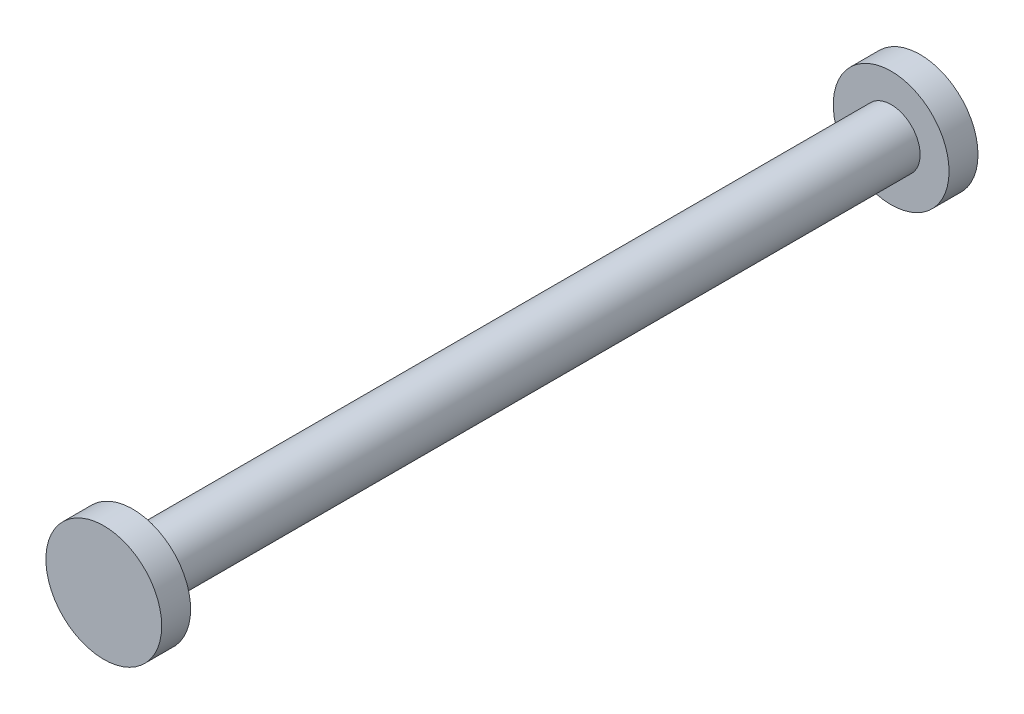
ISO-10303-21;
HEADER;
FILE_DESCRIPTION(('STEP AP214'),'2;1');
FILE_NAME('part.step','',(''),(''),'','','');
FILE_SCHEMA(('AUTOMOTIVE_DESIGN { 1 0 10303 214 1 1 1 1 }'));
ENDSEC;
DATA;
#1=APPLICATION_CONTEXT('core data for automotive mechanical design processes');
#2=APPLICATION_PROTOCOL_DEFINITION('international standard','automotive_design',2000,#1);
#3=PRODUCT_CONTEXT('',#1,'mechanical');
#4=PRODUCT('Part','Part','',(#3));
#5=PRODUCT_RELATED_PRODUCT_CATEGORY('part','',(#4));
#6=PRODUCT_DEFINITION_FORMATION('','',#4);
#7=PRODUCT_DEFINITION_CONTEXT('part definition',#1,'design');
#8=PRODUCT_DEFINITION('design','',#6,#7);
#9=PRODUCT_DEFINITION_SHAPE('','',#8);
#10=(LENGTH_UNIT() NAMED_UNIT(*) SI_UNIT(.MILLI.,.METRE.));
#11=(NAMED_UNIT(*) PLANE_ANGLE_UNIT() SI_UNIT($,.RADIAN.));
#12=(NAMED_UNIT(*) SI_UNIT($,.STERADIAN.) SOLID_ANGLE_UNIT());
#13=UNCERTAINTY_MEASURE_WITH_UNIT(LENGTH_MEASURE(1.E-05),#10,'distance_accuracy_value','');
#14=(GEOMETRIC_REPRESENTATION_CONTEXT(3) GLOBAL_UNCERTAINTY_ASSIGNED_CONTEXT((#13)) GLOBAL_UNIT_ASSIGNED_CONTEXT((#10,
#11,#12)) REPRESENTATION_CONTEXT('',''));
#15=CARTESIAN_POINT('',(0.,0.,0.));
#16=DIRECTION('',(0.,0.,1.));
#17=DIRECTION('',(1.,0.,0.));
#18=AXIS2_PLACEMENT_3D('',#15,#16,#17);
#19=CARTESIAN_POINT('',(0.,0.,5.));
#20=DIRECTION('',(0.,0.,-1.));
#21=DIRECTION('',(-1.,0.,0.));
#22=AXIS2_PLACEMENT_3D('',#19,#20,#21);
#23=CYLINDRICAL_SURFACE('',#22,10.);
#24=CARTESIAN_POINT('',(0.,0.,5.));
#25=DIRECTION('',(0.,0.,1.));
#26=DIRECTION('',(1.,0.,0.));
#27=AXIS2_PLACEMENT_3D('',#24,#25,#26);
#28=CIRCLE('',#27,10.);
#29=CARTESIAN_POINT('',(10.,0.,5.));
#30=VERTEX_POINT('',#29);
#31=EDGE_CURVE('E38',#30,#30,#28,.T.);
#32=ORIENTED_EDGE('',*,*,#31,.F.);
#33=EDGE_LOOP('',(#32));
#34=FACE_BOUND('',#33,.T.);
#35=CARTESIAN_POINT('',(0.,0.,0.));
#36=DIRECTION('',(0.,0.,1.));
#37=DIRECTION('',(1.,0.,0.));
#38=AXIS2_PLACEMENT_3D('',#35,#36,#37);
#39=CIRCLE('',#38,10.);
#40=CARTESIAN_POINT('',(10.,0.,0.));
#41=VERTEX_POINT('',#40);
#42=EDGE_CURVE('E34',#41,#41,#39,.T.);
#43=ORIENTED_EDGE('',*,*,#42,.T.);
#44=EDGE_LOOP('',(#43));
#45=FACE_BOUND('',#44,.T.);
#46=ADVANCED_FACE('F31',(#34,#45),#23,.T.);
#47=CARTESIAN_POINT('',(0.,0.,5.));
#48=DIRECTION('',(0.,0.,1.));
#49=DIRECTION('',(1.,0.,0.));
#50=AXIS2_PLACEMENT_3D('',#47,#48,#49);
#51=PLANE('',#50);
#52=CARTESIAN_POINT('',(0.,0.,5.));
#53=DIRECTION('',(0.,0.,1.));
#54=DIRECTION('',(1.,0.,0.));
#55=AXIS2_PLACEMENT_3D('',#52,#53,#54);
#56=CIRCLE('',#55,5.);
#57=CARTESIAN_POINT('',(5.,0.,5.));
#58=VERTEX_POINT('',#57);
#59=EDGE_CURVE('E10',#58,#58,#56,.T.);
#60=ORIENTED_EDGE('',*,*,#59,.F.);
#61=EDGE_LOOP('',(#60));
#62=FACE_BOUND('',#61,.T.);
#63=ORIENTED_EDGE('',*,*,#31,.T.);
#64=EDGE_LOOP('',(#63));
#65=FACE_BOUND('',#64,.T.);
#66=ADVANCED_FACE('F72',(#62,#65),#51,.T.);
#67=CARTESIAN_POINT('',(0.,0.,0.));
#68=DIRECTION('',(0.,0.,1.));
#69=DIRECTION('',(1.,0.,0.));
#70=AXIS2_PLACEMENT_3D('',#67,#68,#69);
#71=PLANE('',#70);
#72=ORIENTED_EDGE('',*,*,#42,.F.);
#73=EDGE_LOOP('',(#72));
#74=FACE_BOUND('',#73,.T.);
#75=ADVANCED_FACE('F77',(#74),#71,.F.);
#76=CARTESIAN_POINT('',(0.,0.,136.));
#77=DIRECTION('',(0.,0.,-1.));
#78=DIRECTION('',(-1.,0.,0.));
#79=AXIS2_PLACEMENT_3D('',#76,#77,#78);
#80=CYLINDRICAL_SURFACE('',#79,5.);
#81=CARTESIAN_POINT('',(0.,0.,136.));
#82=DIRECTION('',(0.,0.,1.));
#83=DIRECTION('',(1.,0.,0.));
#84=AXIS2_PLACEMENT_3D('',#81,#82,#83);
#85=CIRCLE('',#84,5.);
#86=CARTESIAN_POINT('',(5.,0.,136.));
#87=VERTEX_POINT('',#86);
#88=EDGE_CURVE('E44',#87,#87,#85,.T.);
#89=ORIENTED_EDGE('',*,*,#88,.F.);
#90=EDGE_LOOP('',(#89));
#91=FACE_BOUND('',#90,.T.);
#92=ORIENTED_EDGE('',*,*,#59,.T.);
#93=EDGE_LOOP('',(#92));
#94=FACE_BOUND('',#93,.T.);
#95=ADVANCED_FACE('F59',(#91,#94),#80,.T.);
#96=CARTESIAN_POINT('',(0.,0.,141.));
#97=DIRECTION('',(0.,0.,-1.));
#98=DIRECTION('',(-1.,0.,0.));
#99=AXIS2_PLACEMENT_3D('',#96,#97,#98);
#100=CYLINDRICAL_SURFACE('',#99,10.);
#101=CARTESIAN_POINT('',(0.,0.,141.));
#102=DIRECTION('',(0.,0.,1.));
#103=DIRECTION('',(1.,0.,0.));
#104=AXIS2_PLACEMENT_3D('',#101,#102,#103);
#105=CIRCLE('',#104,10.);
#106=CARTESIAN_POINT('',(10.,0.,141.));
#107=VERTEX_POINT('',#106);
#108=EDGE_CURVE('E47',#107,#107,#105,.T.);
#109=ORIENTED_EDGE('',*,*,#108,.F.);
#110=EDGE_LOOP('',(#109));
#111=FACE_BOUND('',#110,.T.);
#112=CARTESIAN_POINT('',(0.,0.,136.));
#113=DIRECTION('',(0.,0.,1.));
#114=DIRECTION('',(1.,0.,0.));
#115=AXIS2_PLACEMENT_3D('',#112,#113,#114);
#116=CIRCLE('',#115,10.);
#117=CARTESIAN_POINT('',(10.,0.,136.));
#118=VERTEX_POINT('',#117);
#119=EDGE_CURVE('E48',#118,#118,#116,.T.);
#120=ORIENTED_EDGE('',*,*,#119,.T.);
#121=EDGE_LOOP('',(#120));
#122=FACE_BOUND('',#121,.T.);
#123=ADVANCED_FACE('F56',(#111,#122),#100,.T.);
#124=CARTESIAN_POINT('',(0.,0.,141.));
#125=DIRECTION('',(0.,0.,1.));
#126=DIRECTION('',(1.,0.,0.));
#127=AXIS2_PLACEMENT_3D('',#124,#125,#126);
#128=PLANE('',#127);
#129=ORIENTED_EDGE('',*,*,#108,.T.);
#130=EDGE_LOOP('',(#129));
#131=FACE_BOUND('',#130,.T.);
#132=ADVANCED_FACE('F54',(#131),#128,.T.);
#133=CARTESIAN_POINT('',(0.,0.,136.));
#134=DIRECTION('',(0.,0.,1.));
#135=DIRECTION('',(1.,0.,0.));
#136=AXIS2_PLACEMENT_3D('',#133,#134,#135);
#137=PLANE('',#136);
#138=ORIENTED_EDGE('',*,*,#88,.T.);
#139=EDGE_LOOP('',(#138));
#140=FACE_BOUND('',#139,.T.);
#141=ORIENTED_EDGE('',*,*,#119,.F.);
#142=EDGE_LOOP('',(#141));
#143=FACE_BOUND('',#142,.T.);
#144=ADVANCED_FACE('F63',(#140,#143),#137,.F.);
#145=CLOSED_SHELL('',(#46,#66,#75,#95,#123,#132,#144));
#146=MANIFOLD_SOLID_BREP('B2',#145);
#147=ADVANCED_BREP_SHAPE_REPRESENTATION('',(#18,#146),#14);
#148=SHAPE_DEFINITION_REPRESENTATION(#9,#147);
ENDSEC;
END-ISO-10303-21;
